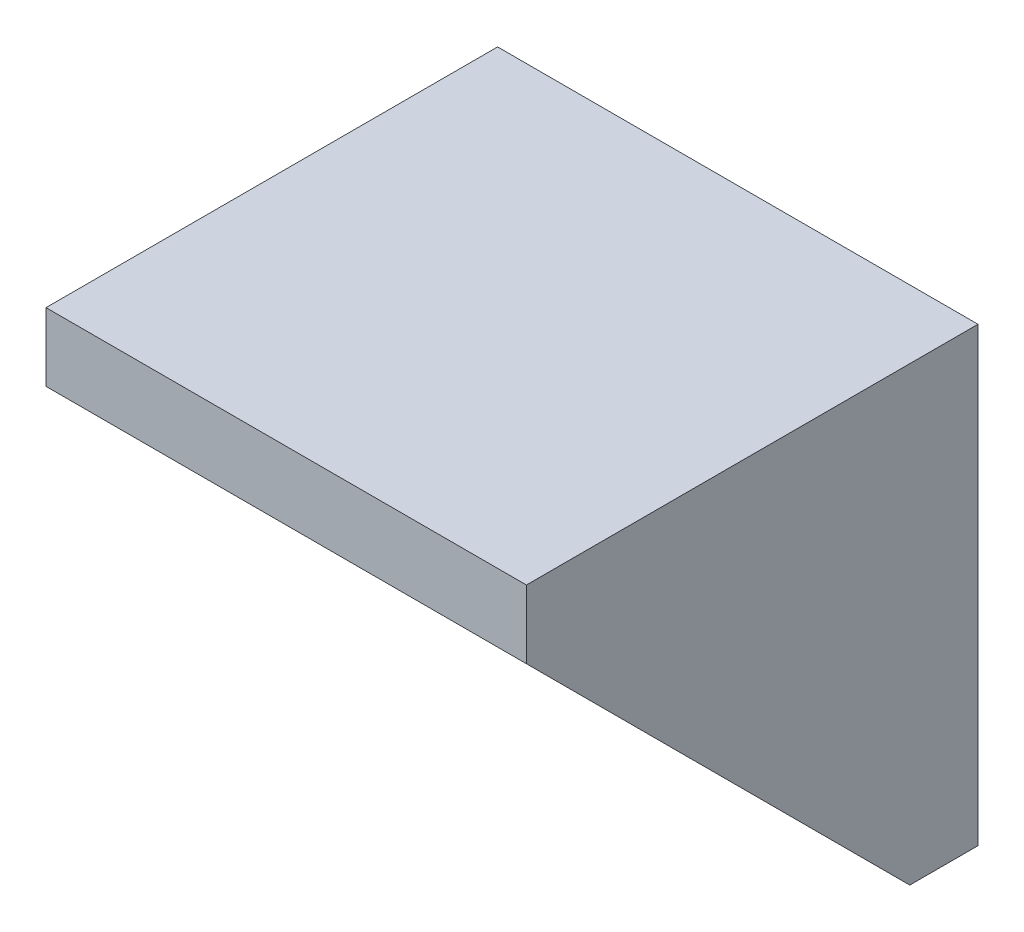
from build123d import *

# Parameters (mm, degrees)
BOSS_EXTRUDE1_DEPTH = 38.1
SKETCH2_W           = 32.004
SKETCH2_H           = 30.4038
CUT_EXTRUDE1_DEPTH  = 30.4038


with BuildPart() as part:
    # Sketch1 → Boss-Extrude1 (new body)
    with BuildSketch(Plane(origin=(0, 0, 0), x_dir=(0, 0, -1), z_dir=(1, 0, 0))):
        Polygon((0, 0), (0, -35.814), (-5.4102, -35.814), (-35.814, -5.4102), (-35.814, 0), align=None)
    extrude(amount=BOSS_EXTRUDE1_DEPTH)

    # Sketch2 → Cut-Extrude1 (cut)
    with BuildSketch(Plane.XY.offset(35.814)):
        with Locations((19.05, -20.6121)):
            Rectangle(SKETCH2_W, SKETCH2_H)
    extrude(amount=-CUT_EXTRUDE1_DEPTH, mode=Mode.SUBTRACT)


solid = part.part
